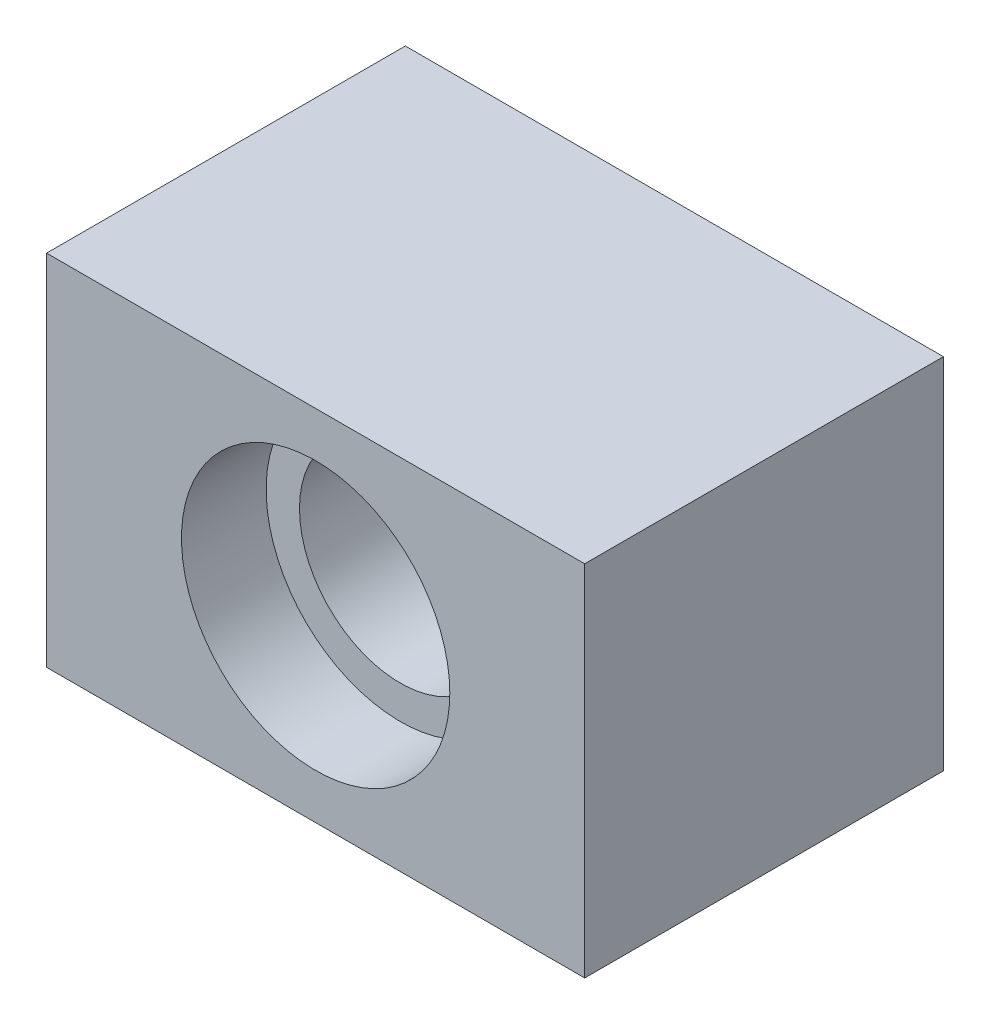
from build123d import *

# Parameters (mm, degrees)
SKETCH2_W               = 38.1
SKETCH2_H               = 25.4
SKETCH2_R               = 7.1374
BOSS_EXTRUDE1_DEPTH     = 12.7
CUT_EXTRUDE1_START      = 12.7
SKETCH3_R               = 9.5
CUT_EXTRUDE1_DEPTH      = 5.9944
CUT_EXTRUDE2_START      = -6.7056
SKETCH4_R               = 9.5
CUT_EXTRUDE2_DEPTH      = 5.9944
CUT_EXTRUDE3_DEPTH      = 2.54
CUT_EXTRUDE3_DEPTH_BACK = 17.2974
SKETCH5_R               = 3.175


with BuildPart() as part:
    # Sketch2 → Boss-Extrude1 (new, symmetric)
    with BuildSketch(Plane.XY):
        Rectangle(SKETCH2_W, SKETCH2_H)
        Circle(SKETCH2_R, mode=Mode.SUBTRACT)
    extrude(amount=BOSS_EXTRUDE1_DEPTH, both=True)

    # Sketch3 → Cut-Extrude1 (cut)
    with BuildSketch(Plane.XY.offset(CUT_EXTRUDE1_START)):
        Circle(SKETCH3_R)
    extrude(amount=-CUT_EXTRUDE1_DEPTH, mode=Mode.SUBTRACT)

    # Sketch4 → Cut-Extrude2 (cut)
    with BuildSketch(Plane.XY.offset(CUT_EXTRUDE2_START)):
        Circle(SKETCH4_R)
    extrude(amount=-CUT_EXTRUDE2_DEPTH, mode=Mode.SUBTRACT)

    # Sketch5 → Cut-Extrude3 (cut, two sides: drawn at the far end of the back side and taken through both)
    with BuildSketch(Plane.XY.offset(-CUT_EXTRUDE3_DEPTH_BACK)):
        with Locations((-14.2748, -6.35)):
            Circle(SKETCH5_R)
        with Locations((14.2748, 6.35)):
            Circle(SKETCH5_R)
    extrude(amount=CUT_EXTRUDE3_DEPTH + CUT_EXTRUDE3_DEPTH_BACK, mode=Mode.SUBTRACT)


solid = part.part
